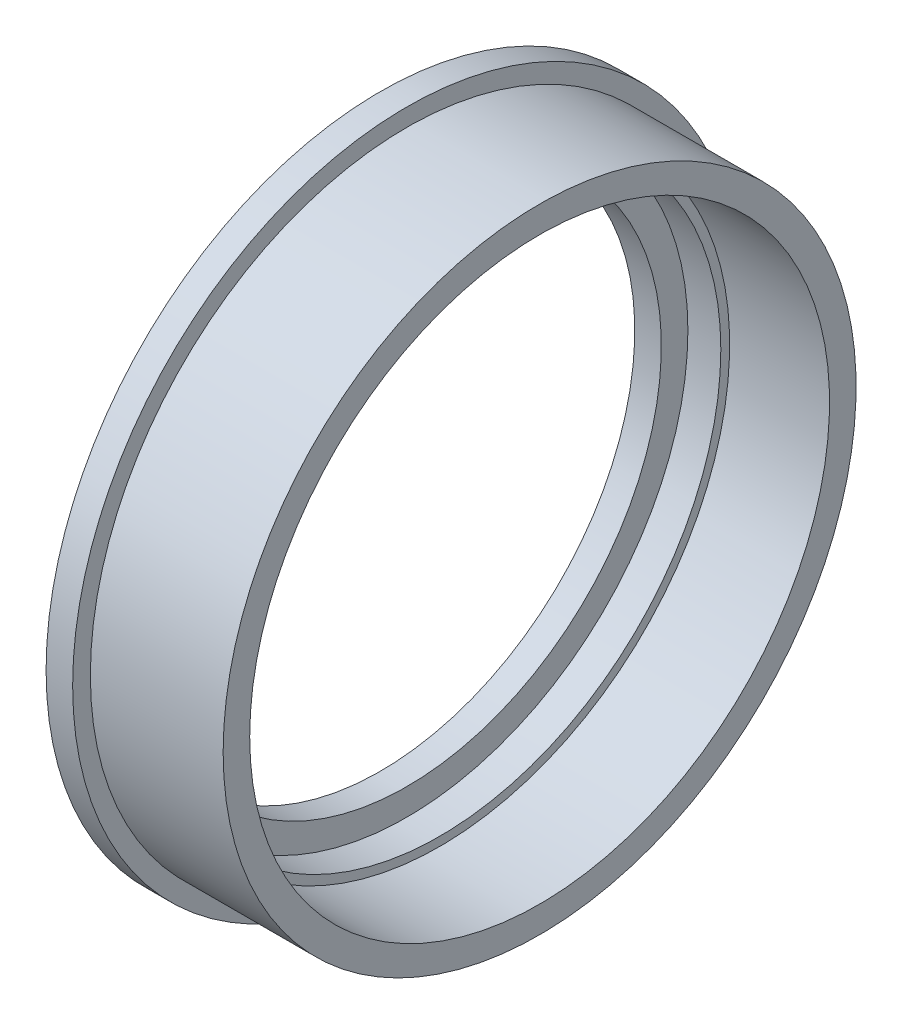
from build123d import *


with BuildPart() as part:
    # Sketch1 → Revolve1 (revolve)
    with BuildSketch(Plane.XY, mode=Mode.PRIVATE) as revolve1_sk:
        Polygon((3.718543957, 31.75), (0, 31.75), (0, 28.75), (-3, 28.75), (-3, 37.75), (0, 37.75), (0, 35.75), (15, 35.75), (15, 32.75), (3.718543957, 32.75), align=None)
    revolve(revolve1_sk.sketch.rotate(Axis((0, 0, 0), (1, 0, 0)), 90), axis=Axis((0, 0, 0), (1, 0, 0)))


solid = part.part
